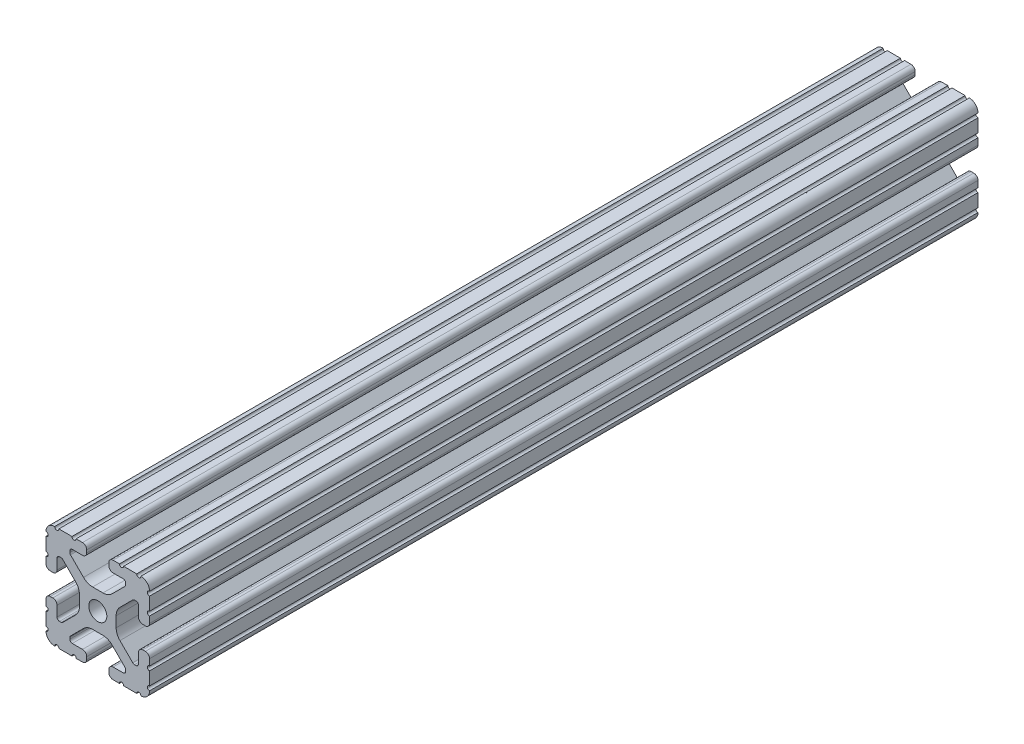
from build123d import *

# Parameters (mm, degrees)
SKETCH1_R      = 3.3274
EXTRUDE1_DEPTH = 304.8


with BuildPart() as part:
    # Sketch1 → Extrude1 (new body)
    with BuildSketch(Plane.XY):
        with BuildLine():
            Line((-10.022898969, 12.91475973), (-5.252158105, 8.144007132))
            ThreePointArc((-5.252158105, 8.144007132), (-3.715177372, 7.117027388), (-1.902183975, 6.7564))
            Line((-1.902183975, 6.7564), (1.902183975, 6.7564))
            ThreePointArc((1.902183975, 6.7564), (3.715177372, 7.117027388), (5.252158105, 8.144007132))
            Line((5.252158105, 8.144007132), (10.022898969, 12.91475973))
            ThreePointArc((10.022898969, 12.91475973), (10.218362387, 13.207291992), (10.287, 13.552357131))
            Line((10.287, 13.552357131), (10.287, 14.0843))
            ThreePointArc((10.287, 14.0843), (10.022898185, 14.721898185), (9.3853, 14.986))
            Line((9.3853, 14.986), (5.617617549, 14.986))
            ThreePointArc((5.617617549, 14.986), (4.519044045, 15.441044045), (4.064, 16.539617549))
            Line((4.064, 16.539617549), (4.064, 17.496382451))
            ThreePointArc((4.064, 17.496382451), (4.519044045, 18.594955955), (5.617617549, 19.05))
            Line((5.617617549, 19.05), (7.974178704, 19.05))
            ThreePointArc((7.974178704, 19.05), (8.736178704, 18.288), (9.498178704, 19.05))
            Line((9.498178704, 19.05), (14.327719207, 19.05))
            ThreePointArc((14.327719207, 19.05), (15.087603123, 18.231251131), (15.847487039, 19.05))
            ThreePointArc((15.847487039, 19.05), (18.120176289, 18.120192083), (19.05, 15.847509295))
            ThreePointArc((19.05, 15.847509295), (18.231250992, 15.08762539), (19.05, 14.327741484))
            Line((19.05, 14.327741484), (19.05, 9.496091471))
            ThreePointArc((19.05, 9.496091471), (18.231250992, 8.736207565), (19.05, 7.97632366))
            Line((19.05, 7.97632366), (19.05, 5.617617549))
            ThreePointArc((19.05, 5.617617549), (18.594955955, 4.519044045), (17.496382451, 4.064))
            Line((17.496382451, 4.064), (16.539617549, 4.064))
            ThreePointArc((16.539617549, 4.064), (15.441044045, 4.519044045), (14.986, 5.617617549))
            Line((14.986, 5.617617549), (14.986, 9.385342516))
            ThreePointArc((14.986, 9.385342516), (14.721898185, 10.022940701), (14.0843, 10.287042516))
            Line((14.0843, 10.287042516), (13.516042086, 10.287042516))
            ThreePointArc((13.516042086, 10.287042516), (13.170975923, 10.218404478), (12.878443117, 10.022939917))
            Line((12.878443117, 10.022939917), (8.14758008, 5.292065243))
            ThreePointArc((8.14758008, 5.292065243), (7.117955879, 3.751120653), (6.7564, 1.933453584))
            Line((6.7564, 1.933453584), (6.7564, -1.933453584))
            ThreePointArc((6.7564, -1.933453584), (7.117955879, -3.751120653), (8.14758008, -5.292065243))
            Line((8.14758008, -5.292065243), (12.878443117, -10.022939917))
            ThreePointArc((12.878443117, -10.022939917), (13.170975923, -10.218404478), (13.516042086, -10.287042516))
            Line((13.516042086, -10.287042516), (14.0843, -10.287042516))
            ThreePointArc((14.0843, -10.287042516), (14.721898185, -10.022940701), (14.986, -9.385342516))
            Line((14.986, -9.385342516), (14.986, -5.617617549))
            ThreePointArc((14.986, -5.617617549), (15.441044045, -4.519044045), (16.539617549, -4.064))
            Line((16.539617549, -4.064), (17.496382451, -4.064))
            ThreePointArc((17.496382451, -4.064), (18.594955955, -4.519044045), (19.05, -5.617617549))
            Line((19.05, -5.617617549), (19.05, -7.976318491))
            ThreePointArc((19.05, -7.976318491), (18.231250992, -8.736202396), (19.05, -9.496086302))
            Line((19.05, -9.496086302), (19.05, -14.32774291))
            ThreePointArc((19.05, -14.32774291), (18.231250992, -15.087626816), (19.05, -15.847510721))
            ThreePointArc((19.05, -15.847510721), (18.120175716, -18.120192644), (15.847486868, -19.05))
            ThreePointArc((15.847486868, -19.05), (15.087602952, -18.231251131), (14.327719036, -19.05))
            Line((14.327719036, -19.05), (9.496062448, -19.05))
            ThreePointArc((9.496062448, -19.05), (8.736178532, -18.231251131), (7.976294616, -19.05))
            Line((7.976294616, -19.05), (5.617617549, -19.05))
            ThreePointArc((5.617617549, -19.05), (4.519044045, -18.594955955), (4.064, -17.496382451))
            Line((4.064, -17.496382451), (4.064, -16.539617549))
            ThreePointArc((4.064, -16.539617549), (4.519044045, -15.441044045), (5.617617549, -14.986))
            Line((5.617617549, -14.986), (9.3853, -14.986))
            ThreePointArc((9.3853, -14.986), (10.022898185, -14.721898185), (10.287, -14.0843))
            Line((10.287, -14.0843), (10.287, -13.552357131))
            ThreePointArc((10.287, -13.552357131), (10.218362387, -13.207291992), (10.022898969, -12.91475973))
            Line((10.022898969, -12.91475973), (5.252158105, -8.144007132))
            ThreePointArc((5.252158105, -8.144007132), (3.715177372, -7.117027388), (1.902183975, -6.7564))
            Line((1.902183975, -6.7564), (-1.902183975, -6.7564))
            ThreePointArc((-1.902183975, -6.7564), (-3.715177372, -7.117027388), (-5.252158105, -8.144007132))
            Line((-5.252158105, -8.144007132), (-10.022898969, -12.91475973))
            ThreePointArc((-10.022898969, -12.91475973), (-10.218362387, -13.207291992), (-10.287, -13.552357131))
            Line((-10.287, -13.552357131), (-10.287, -14.0843))
            ThreePointArc((-10.287, -14.0843), (-10.022898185, -14.721898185), (-9.3853, -14.986))
            Line((-9.3853, -14.986), (-5.617617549, -14.986))
            ThreePointArc((-5.617617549, -14.986), (-4.519044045, -15.441044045), (-4.064, -16.539617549))
            Line((-4.064, -16.539617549), (-4.064, -17.496382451))
            ThreePointArc((-4.064, -17.496382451), (-4.519044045, -18.594955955), (-5.617617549, -19.05))
            Line((-5.617617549, -19.05), (-7.976294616, -19.05))
            ThreePointArc((-7.976294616, -19.05), (-8.736178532, -18.231251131), (-9.496062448, -19.05))
            Line((-9.496062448, -19.05), (-14.327719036, -19.05))
            ThreePointArc((-14.327719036, -19.05), (-15.087602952, -18.231251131), (-15.847486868, -19.05))
            ThreePointArc((-15.847486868, -19.05), (-18.120175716, -18.120192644), (-19.05, -15.847510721))
            ThreePointArc((-19.05, -15.847510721), (-18.231250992, -15.087626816), (-19.05, -14.32774291))
            Line((-19.05, -14.32774291), (-19.05, -9.496086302))
            ThreePointArc((-19.05, -9.496086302), (-18.231250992, -8.736202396), (-19.05, -7.976318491))
            Line((-19.05, -7.976318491), (-19.05, -5.617617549))
            ThreePointArc((-19.05, -5.617617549), (-18.594955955, -4.519044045), (-17.496382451, -4.064))
            Line((-17.496382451, -4.064), (-16.539617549, -4.064))
            ThreePointArc((-16.539617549, -4.064), (-15.441044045, -4.519044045), (-14.986, -5.617617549))
            Line((-14.986, -5.617617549), (-14.986, -9.385342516))
            ThreePointArc((-14.986, -9.385342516), (-14.721898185, -10.022940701), (-14.0843, -10.287042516))
            Line((-14.0843, -10.287042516), (-13.516042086, -10.287042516))
            ThreePointArc((-13.516042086, -10.287042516), (-13.170975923, -10.218404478), (-12.878443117, -10.022939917))
            Line((-12.878443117, -10.022939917), (-8.14758008, -5.292065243))
            ThreePointArc((-8.14758008, -5.292065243), (-7.117955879, -3.751120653), (-6.7564, -1.933453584))
            Line((-6.7564, -1.933453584), (-6.7564, 1.933453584))
            ThreePointArc((-6.7564, 1.933453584), (-7.117955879, 3.751120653), (-8.14758008, 5.292065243))
            Line((-8.14758008, 5.292065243), (-12.878443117, 10.022939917))
            ThreePointArc((-12.878443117, 10.022939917), (-13.170975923, 10.218404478), (-13.516042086, 10.287042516))
            Line((-13.516042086, 10.287042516), (-14.0843, 10.287042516))
            ThreePointArc((-14.0843, 10.287042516), (-14.721898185, 10.022940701), (-14.986, 9.385342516))
            Line((-14.986, 9.385342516), (-14.986, 5.617617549))
            ThreePointArc((-14.986, 5.617617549), (-15.441044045, 4.519044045), (-16.539617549, 4.064))
            Line((-16.539617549, 4.064), (-17.496382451, 4.064))
            ThreePointArc((-17.496382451, 4.064), (-18.594955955, 4.519044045), (-19.05, 5.617617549))
            Line((-19.05, 5.617617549), (-19.05, 7.97632366))
            ThreePointArc((-19.05, 7.97632366), (-18.231250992, 8.736207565), (-19.05, 9.496091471))
            Line((-19.05, 9.496091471), (-19.05, 14.327741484))
            ThreePointArc((-19.05, 14.327741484), (-18.231250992, 15.08762539), (-19.05, 15.847509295))
            ThreePointArc((-19.05, 15.847509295), (-18.120176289, 18.120192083), (-15.847487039, 19.05))
            ThreePointArc((-15.847487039, 19.05), (-15.087603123, 18.231251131), (-14.327719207, 19.05))
            Line((-14.327719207, 19.05), (-9.498178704, 19.05))
            ThreePointArc((-9.498178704, 19.05), (-8.736178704, 18.288), (-7.974178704, 19.05))
            Line((-7.974178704, 19.05), (-5.617617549, 19.05))
            ThreePointArc((-5.617617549, 19.05), (-4.519044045, 18.594955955), (-4.064, 17.496382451))
            Line((-4.064, 17.496382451), (-4.064, 16.539617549))
            ThreePointArc((-4.064, 16.539617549), (-4.519044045, 15.441044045), (-5.617617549, 14.986))
            Line((-5.617617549, 14.986), (-9.3853, 14.986))
            ThreePointArc((-9.3853, 14.986), (-10.022898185, 14.721898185), (-10.287, 14.0843))
            Line((-10.287, 14.0843), (-10.287, 13.552357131))
            ThreePointArc((-10.287, 13.552357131), (-10.218362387, 13.207291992), (-10.022898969, 12.91475973))
        make_face()
        Circle(SKETCH1_R, mode=Mode.SUBTRACT)
    extrude(amount=-EXTRUDE1_DEPTH)


solid = part.part
